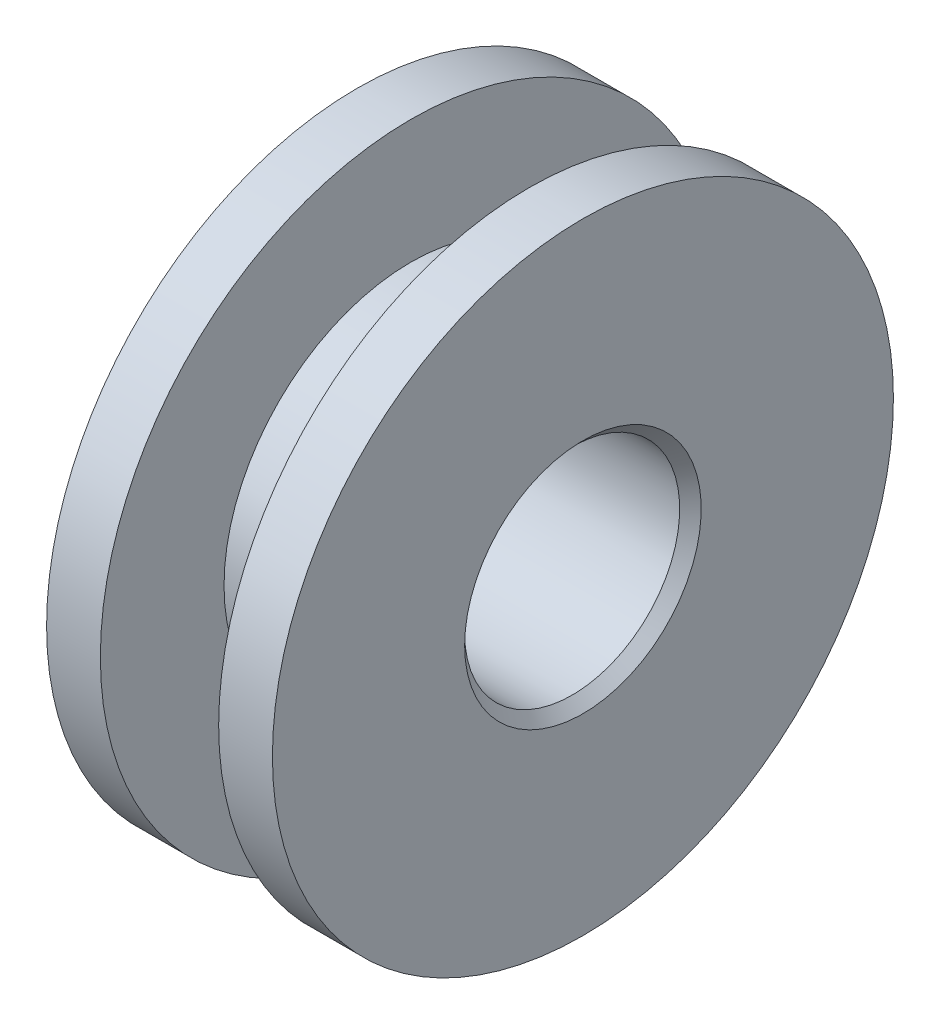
from build123d import *

# Parameters (mm, degrees)
CHAMFER1_SIZE = 0.5


with BuildPart() as part:
    # Sketch2 → Revolve1 (revolve)
    with BuildSketch(Plane.XY, mode=Mode.PRIVATE) as revolve1_sk:
        Polygon((0, 5), (0, 14.436009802), (2.5, 14.436009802), (2.5, 8.686009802), (8, 8.686009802), (8, 14.436009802), (10.5, 14.436009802), (10.5, 5), align=None)
    revolve(revolve1_sk.sketch.rotate(Axis((0, 0, 0), (1, 0, 0)), 90), axis=Axis((0, 0, 0), (1, 0, 0)))

    # Chamfer1
    chamfer1_edges = [part.edges().sort_by_distance(p)[0] for p in [
        (10.5, 0, -5),
        (0, 0, -5),
    ]]
    chamfer(chamfer1_edges, length=CHAMFER1_SIZE)


solid = part.part
